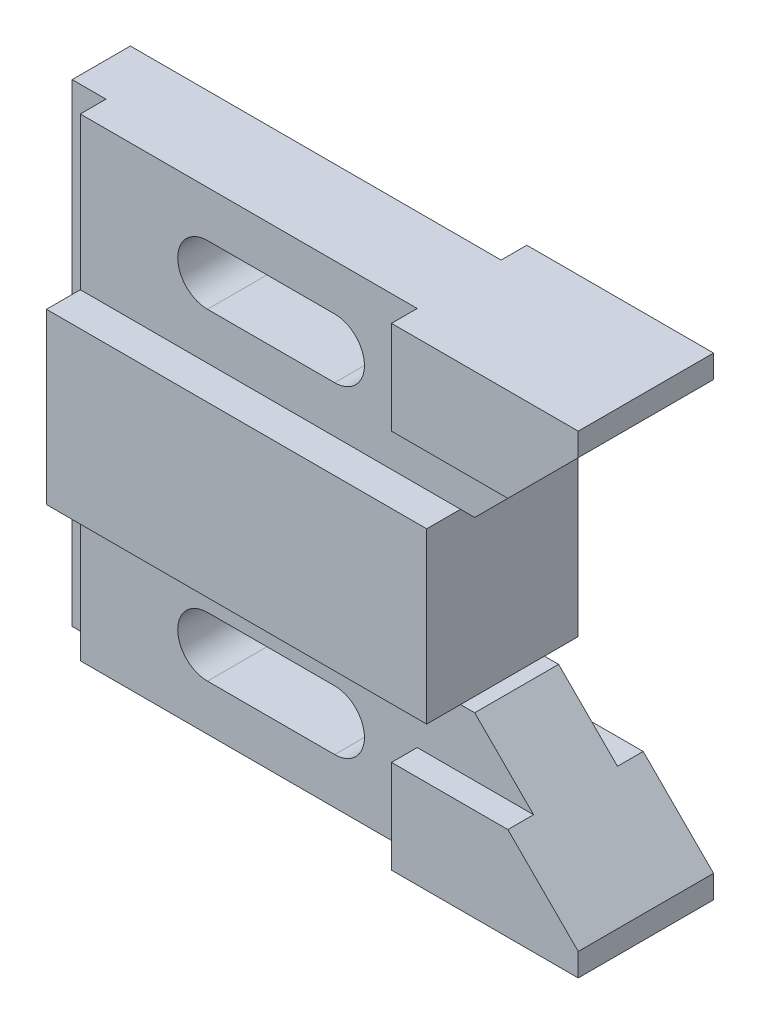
ISO-10303-21;
HEADER;
FILE_DESCRIPTION(('STEP AP214'),'2;1');
FILE_NAME('part.step','',(''),(''),'','','');
FILE_SCHEMA(('AUTOMOTIVE_DESIGN { 1 0 10303 214 1 1 1 1 }'));
ENDSEC;
DATA;
#1=APPLICATION_CONTEXT('core data for automotive mechanical design processes');
#2=APPLICATION_PROTOCOL_DEFINITION('international standard','automotive_design',2000,#1);
#3=PRODUCT_CONTEXT('',#1,'mechanical');
#4=PRODUCT('Part','Part','',(#3));
#5=PRODUCT_RELATED_PRODUCT_CATEGORY('part','',(#4));
#6=PRODUCT_DEFINITION_FORMATION('','',#4);
#7=PRODUCT_DEFINITION_CONTEXT('part definition',#1,'design');
#8=PRODUCT_DEFINITION('design','',#6,#7);
#9=PRODUCT_DEFINITION_SHAPE('','',#8);
#10=(LENGTH_UNIT() NAMED_UNIT(*) SI_UNIT(.MILLI.,.METRE.));
#11=(NAMED_UNIT(*) PLANE_ANGLE_UNIT() SI_UNIT($,.RADIAN.));
#12=(NAMED_UNIT(*) SI_UNIT($,.STERADIAN.) SOLID_ANGLE_UNIT());
#13=UNCERTAINTY_MEASURE_WITH_UNIT(LENGTH_MEASURE(1.E-05),#10,'distance_accuracy_value','');
#14=(GEOMETRIC_REPRESENTATION_CONTEXT(3) GLOBAL_UNCERTAINTY_ASSIGNED_CONTEXT((#13)) GLOBAL_UNIT_ASSIGNED_CONTEXT((#10,
#11,#12)) REPRESENTATION_CONTEXT('',''));
#15=CARTESIAN_POINT('',(0.,0.,0.));
#16=DIRECTION('',(0.,0.,1.));
#17=DIRECTION('',(1.,0.,0.));
#18=AXIS2_PLACEMENT_3D('',#15,#16,#17);
#19=CARTESIAN_POINT('',(0.,0.,-7.874));
#20=DIRECTION('',(0.,0.,-1.));
#21=DIRECTION('',(1.,0.,0.));
#22=AXIS2_PLACEMENT_3D('',#19,#20,#21);
#23=PLANE('',#22);
#24=CARTESIAN_POINT('',(30.226,-14.224,-7.874));
#25=DIRECTION('',(0.,0.,1.));
#26=DIRECTION('',(1.,0.,0.));
#27=AXIS2_PLACEMENT_3D('',#24,#25,#26);
#28=CIRCLE('',#27,5.588);
#29=CARTESIAN_POINT('',(30.226,-8.63599999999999,-7.874));
#30=VERTEX_POINT('',#29);
#31=CARTESIAN_POINT('',(30.226,-19.812,-7.874));
#32=VERTEX_POINT('',#31);
#33=EDGE_CURVE('E623',#30,#32,#28,.T.);
#34=ORIENTED_EDGE('',*,*,#33,.T.);
#35=DIRECTION('',(1.,0.,0.));
#36=VECTOR('',#35,1.);
#37=CARTESIAN_POINT('',(30.226,-19.812,-7.874));
#38=LINE('',#37,#36);
#39=CARTESIAN_POINT('',(54.102,-19.812,-7.874));
#40=VERTEX_POINT('',#39);
#41=EDGE_CURVE('E486',#32,#40,#38,.T.);
#42=ORIENTED_EDGE('',*,*,#41,.T.);
#43=CARTESIAN_POINT('',(54.102,-14.224,-7.874));
#44=DIRECTION('',(0.,0.,1.));
#45=DIRECTION('',(1.,0.,0.));
#46=AXIS2_PLACEMENT_3D('',#43,#44,#45);
#47=CIRCLE('',#46,5.588);
#48=CARTESIAN_POINT('',(54.102,-8.63599999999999,-7.874));
#49=VERTEX_POINT('',#48);
#50=EDGE_CURVE('E631',#40,#49,#47,.T.);
#51=ORIENTED_EDGE('',*,*,#50,.T.);
#52=DIRECTION('',(-1.,0.,0.));
#53=VECTOR('',#52,1.);
#54=CARTESIAN_POINT('',(30.226,-8.63599999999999,-7.874));
#55=LINE('',#54,#53);
#56=EDGE_CURVE('E633',#49,#30,#55,.T.);
#57=ORIENTED_EDGE('',*,*,#56,.T.);
#58=EDGE_LOOP('',(#34,#42,#51,#57));
#59=FACE_BOUND('',#58,.T.);
#60=DIRECTION('',(-1.,0.,0.));
#61=VECTOR('',#60,1.);
#62=CARTESIAN_POINT('',(6.35000000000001,-28.575,-7.874));
#63=LINE('',#62,#61);
#64=CARTESIAN_POINT('',(77.724,-28.575,-7.874));
#65=VERTEX_POINT('',#64);
#66=CARTESIAN_POINT('',(0.,-28.575,-7.874));
#67=VERTEX_POINT('',#66);
#68=EDGE_CURVE('E62',#65,#67,#63,.T.);
#69=ORIENTED_EDGE('',*,*,#68,.T.);
#70=DIRECTION('',(0.,-1.,0.));
#71=VECTOR('',#70,1.);
#72=CARTESIAN_POINT('',(0.,0.,-7.874));
#73=LINE('',#72,#71);
#74=CARTESIAN_POINT('',(0.,0.,-7.874));
#75=VERTEX_POINT('',#74);
#76=EDGE_CURVE('E304',#75,#67,#73,.T.);
#77=ORIENTED_EDGE('',*,*,#76,.F.);
#78=DIRECTION('',(-1.,0.,0.));
#79=VECTOR('',#78,1.);
#80=CARTESIAN_POINT('',(104.648,0.,-7.874));
#81=LINE('',#80,#79);
#82=CARTESIAN_POINT('',(69.596,0.,-7.874));
#83=VERTEX_POINT('',#82);
#84=EDGE_CURVE('E390',#83,#75,#81,.T.);
#85=ORIENTED_EDGE('',*,*,#84,.F.);
#86=DIRECTION('',(0.,-1.,0.));
#87=VECTOR('',#86,1.);
#88=CARTESIAN_POINT('',(69.596,0.,-7.874));
#89=LINE('',#88,#87);
#90=CARTESIAN_POINT('',(69.596,-17.526,-7.874));
#91=VERTEX_POINT('',#90);
#92=EDGE_CURVE('E353',#83,#91,#89,.T.);
#93=ORIENTED_EDGE('',*,*,#92,.T.);
#94=DIRECTION('',(1.,0.,0.));
#95=VECTOR('',#94,1.);
#96=CARTESIAN_POINT('',(69.596,-17.526,-7.874));
#97=LINE('',#96,#95);
#98=CARTESIAN_POINT('',(91.4394686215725,-17.526,-7.874));
#99=VERTEX_POINT('',#98);
#100=EDGE_CURVE('E348',#91,#99,#97,.T.);
#101=ORIENTED_EDGE('',*,*,#100,.T.);
#102=DIRECTION('',(0.707106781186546,0.707106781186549,0.));
#103=VECTOR('',#102,1.);
#104=CARTESIAN_POINT('',(104.648,-4.31746862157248,-7.874));
#105=LINE('',#104,#103);
#106=CARTESIAN_POINT('',(80.3904686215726,-28.575,-7.874));
#107=VERTEX_POINT('',#106);
#108=EDGE_CURVE('E374',#107,#99,#105,.T.);
#109=ORIENTED_EDGE('',*,*,#108,.F.);
#110=DIRECTION('',(1.,0.,0.));
#111=VECTOR('',#110,1.);
#112=CARTESIAN_POINT('',(80.3904686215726,-28.575,-7.874));
#113=LINE('',#112,#111);
#114=EDGE_CURVE('E492',#65,#107,#113,.T.);
#115=ORIENTED_EDGE('',*,*,#114,.F.);
#116=EDGE_LOOP('',(#69,#77,#85,#93,#101,#109,#115));
#117=FACE_BOUND('',#116,.T.);
#118=ADVANCED_FACE('F37',(#59,#117),#23,.T.);
#119=CARTESIAN_POINT('',(30.226,-74.676,-7.874));
#120=DIRECTION('',(0.,0.,1.));
#121=DIRECTION('',(1.,0.,0.));
#122=AXIS2_PLACEMENT_3D('',#119,#120,#121);
#123=CIRCLE('',#122,5.58800000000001);
#124=CARTESIAN_POINT('',(30.226,-69.088,-7.874));
#125=VERTEX_POINT('',#124);
#126=CARTESIAN_POINT('',(30.226,-80.264,-7.874));
#127=VERTEX_POINT('',#126);
#128=EDGE_CURVE('E379',#125,#127,#123,.T.);
#129=ORIENTED_EDGE('',*,*,#128,.T.);
#130=DIRECTION('',(1.,0.,0.));
#131=VECTOR('',#130,1.);
#132=CARTESIAN_POINT('',(30.226,-80.264,-7.874));
#133=LINE('',#132,#131);
#134=CARTESIAN_POINT('',(54.102,-80.264,-7.874));
#135=VERTEX_POINT('',#134);
#136=EDGE_CURVE('E634',#127,#135,#133,.T.);
#137=ORIENTED_EDGE('',*,*,#136,.T.);
#138=CARTESIAN_POINT('',(54.102,-74.676,-7.874));
#139=DIRECTION('',(0.,0.,1.));
#140=DIRECTION('',(1.,0.,0.));
#141=AXIS2_PLACEMENT_3D('',#138,#139,#140);
#142=CIRCLE('',#141,5.58800000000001);
#143=CARTESIAN_POINT('',(54.102,-69.088,-7.874));
#144=VERTEX_POINT('',#143);
#145=EDGE_CURVE('E638',#135,#144,#142,.T.);
#146=ORIENTED_EDGE('',*,*,#145,.T.);
#147=DIRECTION('',(-1.,0.,0.));
#148=VECTOR('',#147,1.);
#149=CARTESIAN_POINT('',(30.226,-69.088,-7.874));
#150=LINE('',#149,#148);
#151=EDGE_CURVE('E1207',#144,#125,#150,.T.);
#152=ORIENTED_EDGE('',*,*,#151,.T.);
#153=EDGE_LOOP('',(#129,#137,#146,#152));
#154=FACE_BOUND('',#153,.T.);
#155=CARTESIAN_POINT('',(0.,-60.325,-7.874));
#156=VERTEX_POINT('',#155);
#157=CARTESIAN_POINT('',(0.,-88.9,-7.874));
#158=VERTEX_POINT('',#157);
#159=EDGE_CURVE('E503',#156,#158,#73,.T.);
#160=ORIENTED_EDGE('',*,*,#159,.F.);
#161=DIRECTION('',(1.,0.,0.));
#162=VECTOR('',#161,1.);
#163=CARTESIAN_POINT('',(6.35000000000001,-60.325,-7.874));
#164=LINE('',#163,#162);
#165=CARTESIAN_POINT('',(77.724,-60.325,-7.874));
#166=VERTEX_POINT('',#165);
#167=EDGE_CURVE('E54',#156,#166,#164,.T.);
#168=ORIENTED_EDGE('',*,*,#167,.T.);
#169=DIRECTION('',(-1.,0.,0.));
#170=VECTOR('',#169,1.);
#171=CARTESIAN_POINT('',(80.3904686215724,-60.325,-7.874));
#172=LINE('',#171,#170);
#173=CARTESIAN_POINT('',(80.3904686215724,-60.325,-7.874));
#174=VERTEX_POINT('',#173);
#175=EDGE_CURVE('E495',#174,#166,#172,.T.);
#176=ORIENTED_EDGE('',*,*,#175,.F.);
#177=DIRECTION('',(-0.707106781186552,0.707106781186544,0.));
#178=VECTOR('',#177,1.);
#179=CARTESIAN_POINT('',(104.648,-84.5825313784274,-7.874));
#180=LINE('',#179,#178);
#181=CARTESIAN_POINT('',(91.4394686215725,-71.374,-7.874));
#182=VERTEX_POINT('',#181);
#183=EDGE_CURVE('E498',#182,#174,#180,.T.);
#184=ORIENTED_EDGE('',*,*,#183,.F.);
#185=DIRECTION('',(-1.,0.,0.));
#186=VECTOR('',#185,1.);
#187=CARTESIAN_POINT('',(91.4394686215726,-71.374,-7.874));
#188=LINE('',#187,#186);
#189=CARTESIAN_POINT('',(69.596,-71.374,-7.874));
#190=VERTEX_POINT('',#189);
#191=EDGE_CURVE('E320',#182,#190,#188,.T.);
#192=ORIENTED_EDGE('',*,*,#191,.T.);
#193=DIRECTION('',(0.,-1.,0.));
#194=VECTOR('',#193,1.);
#195=CARTESIAN_POINT('',(69.596,-71.374,-7.874));
#196=LINE('',#195,#194);
#197=CARTESIAN_POINT('',(69.596,-88.9,-7.874));
#198=VERTEX_POINT('',#197);
#199=EDGE_CURVE('E325',#190,#198,#196,.T.);
#200=ORIENTED_EDGE('',*,*,#199,.T.);
#201=DIRECTION('',(1.,0.,0.));
#202=VECTOR('',#201,1.);
#203=CARTESIAN_POINT('',(0.,-88.9,-7.874));
#204=LINE('',#203,#202);
#205=EDGE_CURVE('E500',#158,#198,#204,.T.);
#206=ORIENTED_EDGE('',*,*,#205,.F.);
#207=EDGE_LOOP('',(#160,#168,#176,#184,#192,#200,#206));
#208=FACE_BOUND('',#207,.T.);
#209=ADVANCED_FACE('F656',(#154,#208),#23,.T.);
#210=CARTESIAN_POINT('',(0.,0.,7.874));
#211=DIRECTION('',(0.,0.,1.));
#212=DIRECTION('',(1.,0.,0.));
#213=AXIS2_PLACEMENT_3D('',#210,#211,#212);
#214=PLANE('',#213);
#215=DIRECTION('',(1.,0.,0.));
#216=VECTOR('',#215,1.);
#217=CARTESIAN_POINT('',(30.226,-80.264,7.874));
#218=LINE('',#217,#216);
#219=CARTESIAN_POINT('',(30.226,-80.264,7.874));
#220=VERTEX_POINT('',#219);
#221=CARTESIAN_POINT('',(54.102,-80.264,7.874));
#222=VERTEX_POINT('',#221);
#223=EDGE_CURVE('E585',#220,#222,#218,.T.);
#224=ORIENTED_EDGE('',*,*,#223,.F.);
#225=CARTESIAN_POINT('',(30.226,-74.676,7.874));
#226=DIRECTION('',(0.,0.,1.));
#227=DIRECTION('',(1.,0.,0.));
#228=AXIS2_PLACEMENT_3D('',#225,#226,#227);
#229=CIRCLE('',#228,5.58800000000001);
#230=CARTESIAN_POINT('',(30.226,-69.088,7.874));
#231=VERTEX_POINT('',#230);
#232=EDGE_CURVE('E583',#231,#220,#229,.T.);
#233=ORIENTED_EDGE('',*,*,#232,.F.);
#234=DIRECTION('',(-1.,0.,0.));
#235=VECTOR('',#234,1.);
#236=CARTESIAN_POINT('',(30.226,-69.088,7.874));
#237=LINE('',#236,#235);
#238=CARTESIAN_POINT('',(54.102,-69.088,7.874));
#239=VERTEX_POINT('',#238);
#240=EDGE_CURVE('E590',#239,#231,#237,.T.);
#241=ORIENTED_EDGE('',*,*,#240,.F.);
#242=CARTESIAN_POINT('',(54.102,-74.676,7.874));
#243=DIRECTION('',(0.,0.,1.));
#244=DIRECTION('',(1.,0.,0.));
#245=AXIS2_PLACEMENT_3D('',#242,#243,#244);
#246=CIRCLE('',#245,5.58800000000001);
#247=EDGE_CURVE('E587',#222,#239,#246,.T.);
#248=ORIENTED_EDGE('',*,*,#247,.F.);
#249=EDGE_LOOP('',(#224,#233,#241,#248));
#250=FACE_BOUND('',#249,.T.);
#251=DIRECTION('',(-1.,0.,0.));
#252=VECTOR('',#251,1.);
#253=CARTESIAN_POINT('',(80.3904686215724,-60.325,7.874));
#254=LINE('',#253,#252);
#255=CARTESIAN_POINT('',(80.3904686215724,-60.325,7.874));
#256=VERTEX_POINT('',#255);
#257=CARTESIAN_POINT('',(77.724,-60.325,7.874));
#258=VERTEX_POINT('',#257);
#259=EDGE_CURVE('E449',#256,#258,#254,.T.);
#260=ORIENTED_EDGE('',*,*,#259,.T.);
#261=DIRECTION('',(1.,0.,0.));
#262=VECTOR('',#261,1.);
#263=CARTESIAN_POINT('',(6.35000000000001,-60.325,7.874));
#264=LINE('',#263,#262);
#265=CARTESIAN_POINT('',(6.35000000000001,-60.325,7.874));
#266=VERTEX_POINT('',#265);
#267=EDGE_CURVE('E505',#266,#258,#264,.T.);
#268=ORIENTED_EDGE('',*,*,#267,.F.);
#269=DIRECTION('',(0.,1.,0.));
#270=VECTOR('',#269,1.);
#271=CARTESIAN_POINT('',(6.35,0.,7.874));
#272=LINE('',#271,#270);
#273=CARTESIAN_POINT('',(6.35000000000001,-88.9,7.874));
#274=VERTEX_POINT('',#273);
#275=EDGE_CURVE('E533',#274,#266,#272,.T.);
#276=ORIENTED_EDGE('',*,*,#275,.F.);
#277=DIRECTION('',(1.,0.,0.));
#278=VECTOR('',#277,1.);
#279=CARTESIAN_POINT('',(0.,-88.9,7.874));
#280=LINE('',#279,#278);
#281=CARTESIAN_POINT('',(69.596,-88.9,7.874));
#282=VERTEX_POINT('',#281);
#283=EDGE_CURVE('E439',#274,#282,#280,.T.);
#284=ORIENTED_EDGE('',*,*,#283,.T.);
#285=DIRECTION('',(0.,-1.,0.));
#286=VECTOR('',#285,1.);
#287=CARTESIAN_POINT('',(69.596,-71.374,7.874));
#288=LINE('',#287,#286);
#289=CARTESIAN_POINT('',(69.596,-71.374,7.874));
#290=VERTEX_POINT('',#289);
#291=EDGE_CURVE('E552',#290,#282,#288,.T.);
#292=ORIENTED_EDGE('',*,*,#291,.F.);
#293=DIRECTION('',(-1.,0.,0.));
#294=VECTOR('',#293,1.);
#295=CARTESIAN_POINT('',(91.4394686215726,-71.374,7.874));
#296=LINE('',#295,#294);
#297=CARTESIAN_POINT('',(91.4394686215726,-71.374,7.874));
#298=VERTEX_POINT('',#297);
#299=EDGE_CURVE('E545',#298,#290,#296,.T.);
#300=ORIENTED_EDGE('',*,*,#299,.F.);
#301=DIRECTION('',(-0.707106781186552,0.707106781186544,0.));
#302=VECTOR('',#301,1.);
#303=CARTESIAN_POINT('',(104.648,-84.5825313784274,7.874));
#304=LINE('',#303,#302);
#305=EDGE_CURVE('E447',#298,#256,#304,.T.);
#306=ORIENTED_EDGE('',*,*,#305,.T.);
#307=EDGE_LOOP('',(#260,#268,#276,#284,#292,#300,#306));
#308=FACE_BOUND('',#307,.T.);
#309=ADVANCED_FACE('F649',(#250,#308),#214,.T.);
#310=DIRECTION('',(1.,0.,0.));
#311=VECTOR('',#310,1.);
#312=CARTESIAN_POINT('',(30.226,-19.812,7.874));
#313=LINE('',#312,#311);
#314=CARTESIAN_POINT('',(30.226,-19.812,7.874));
#315=VERTEX_POINT('',#314);
#316=CARTESIAN_POINT('',(54.102,-19.812,7.874));
#317=VERTEX_POINT('',#316);
#318=EDGE_CURVE('E602',#315,#317,#313,.T.);
#319=ORIENTED_EDGE('',*,*,#318,.F.);
#320=CARTESIAN_POINT('',(30.226,-14.224,7.874));
#321=DIRECTION('',(0.,0.,1.));
#322=DIRECTION('',(1.,0.,0.));
#323=AXIS2_PLACEMENT_3D('',#320,#321,#322);
#324=CIRCLE('',#323,5.588);
#325=CARTESIAN_POINT('',(30.226,-8.63599999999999,7.874));
#326=VERTEX_POINT('',#325);
#327=EDGE_CURVE('E600',#326,#315,#324,.T.);
#328=ORIENTED_EDGE('',*,*,#327,.F.);
#329=DIRECTION('',(-1.,0.,0.));
#330=VECTOR('',#329,1.);
#331=CARTESIAN_POINT('',(30.226,-8.63599999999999,7.874));
#332=LINE('',#331,#330);
#333=CARTESIAN_POINT('',(54.102,-8.63599999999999,7.874));
#334=VERTEX_POINT('',#333);
#335=EDGE_CURVE('E607',#334,#326,#332,.T.);
#336=ORIENTED_EDGE('',*,*,#335,.F.);
#337=CARTESIAN_POINT('',(54.102,-14.224,7.874));
#338=DIRECTION('',(0.,0.,1.));
#339=DIRECTION('',(1.,0.,0.));
#340=AXIS2_PLACEMENT_3D('',#337,#338,#339);
#341=CIRCLE('',#340,5.588);
#342=EDGE_CURVE('E604',#317,#334,#341,.T.);
#343=ORIENTED_EDGE('',*,*,#342,.F.);
#344=EDGE_LOOP('',(#319,#328,#336,#343));
#345=FACE_BOUND('',#344,.T.);
#346=CARTESIAN_POINT('',(6.35,-28.575,7.874));
#347=VERTEX_POINT('',#346);
#348=CARTESIAN_POINT('',(6.35,0.,7.874));
#349=VERTEX_POINT('',#348);
#350=EDGE_CURVE('E528',#347,#349,#272,.T.);
#351=ORIENTED_EDGE('',*,*,#350,.F.);
#352=DIRECTION('',(-1.,0.,0.));
#353=VECTOR('',#352,1.);
#354=CARTESIAN_POINT('',(6.35000000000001,-28.575,7.874));
#355=LINE('',#354,#353);
#356=CARTESIAN_POINT('',(77.724,-28.575,7.874));
#357=VERTEX_POINT('',#356);
#358=EDGE_CURVE('E510',#357,#347,#355,.T.);
#359=ORIENTED_EDGE('',*,*,#358,.F.);
#360=DIRECTION('',(1.,0.,0.));
#361=VECTOR('',#360,1.);
#362=CARTESIAN_POINT('',(80.3904686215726,-28.575,7.874));
#363=LINE('',#362,#361);
#364=CARTESIAN_POINT('',(80.3904686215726,-28.575,7.874));
#365=VERTEX_POINT('',#364);
#366=EDGE_CURVE('E452',#357,#365,#363,.T.);
#367=ORIENTED_EDGE('',*,*,#366,.T.);
#368=DIRECTION('',(0.707106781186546,0.707106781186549,0.));
#369=VECTOR('',#368,1.);
#370=CARTESIAN_POINT('',(104.648,-4.31746862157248,7.874));
#371=LINE('',#370,#369);
#372=CARTESIAN_POINT('',(91.4394686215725,-17.526,7.874));
#373=VERTEX_POINT('',#372);
#374=EDGE_CURVE('E417',#365,#373,#371,.T.);
#375=ORIENTED_EDGE('',*,*,#374,.T.);
#376=DIRECTION('',(1.,0.,0.));
#377=VECTOR('',#376,1.);
#378=CARTESIAN_POINT('',(69.596,-17.526,7.874));
#379=LINE('',#378,#377);
#380=CARTESIAN_POINT('',(69.596,-17.526,7.874));
#381=VERTEX_POINT('',#380);
#382=EDGE_CURVE('E462',#381,#373,#379,.T.);
#383=ORIENTED_EDGE('',*,*,#382,.F.);
#384=DIRECTION('',(0.,-1.,0.));
#385=VECTOR('',#384,1.);
#386=CARTESIAN_POINT('',(69.596,0.,7.874));
#387=LINE('',#386,#385);
#388=CARTESIAN_POINT('',(69.596,0.,7.874));
#389=VERTEX_POINT('',#388);
#390=EDGE_CURVE('E474',#389,#381,#387,.T.);
#391=ORIENTED_EDGE('',*,*,#390,.F.);
#392=DIRECTION('',(-1.,0.,0.));
#393=VECTOR('',#392,1.);
#394=CARTESIAN_POINT('',(104.648,0.,7.874));
#395=LINE('',#394,#393);
#396=EDGE_CURVE('E435',#389,#349,#395,.T.);
#397=ORIENTED_EDGE('',*,*,#396,.T.);
#398=EDGE_LOOP('',(#351,#359,#367,#375,#383,#391,#397));
#399=FACE_BOUND('',#398,.T.);
#400=ADVANCED_FACE('F461',(#345,#399),#214,.T.);
#401=CARTESIAN_POINT('',(104.648,0.,7.874));
#402=DIRECTION('',(0.,-1.,0.));
#403=DIRECTION('',(1.,0.,0.));
#404=AXIS2_PLACEMENT_3D('',#401,#402,#403);
#405=PLANE('',#404);
#406=DIRECTION('',(-1.,0.,0.));
#407=VECTOR('',#406,1.);
#408=CARTESIAN_POINT('',(6.35,0.,3.048));
#409=LINE('',#408,#407);
#410=CARTESIAN_POINT('',(6.35,0.,3.048));
#411=VERTEX_POINT('',#410);
#412=CARTESIAN_POINT('',(0.,0.,3.048));
#413=VERTEX_POINT('',#412);
#414=EDGE_CURVE('E532',#411,#413,#409,.T.);
#415=ORIENTED_EDGE('',*,*,#414,.F.);
#416=DIRECTION('',(0.,0.,1.));
#417=VECTOR('',#416,1.);
#418=CARTESIAN_POINT('',(6.35,0.,3.048));
#419=LINE('',#418,#417);
#420=EDGE_CURVE('E540',#411,#349,#419,.T.);
#421=ORIENTED_EDGE('',*,*,#420,.T.);
#422=ORIENTED_EDGE('',*,*,#396,.F.);
#423=DIRECTION('',(0.,0.,-1.));
#424=VECTOR('',#423,1.);
#425=CARTESIAN_POINT('',(69.596,0.,12.7));
#426=LINE('',#425,#424);
#427=CARTESIAN_POINT('',(69.596,0.,12.7));
#428=VERTEX_POINT('',#427);
#429=EDGE_CURVE('E478',#428,#389,#426,.T.);
#430=ORIENTED_EDGE('',*,*,#429,.F.);
#431=DIRECTION('',(-1.,0.,0.));
#432=VECTOR('',#431,1.);
#433=CARTESIAN_POINT('',(69.596,0.,12.7));
#434=LINE('',#433,#432);
#435=CARTESIAN_POINT('',(104.648,0.,12.7));
#436=VERTEX_POINT('',#435);
#437=EDGE_CURVE('E473',#436,#428,#434,.T.);
#438=ORIENTED_EDGE('',*,*,#437,.F.);
#439=DIRECTION('',(0.,0.,-1.));
#440=VECTOR('',#439,1.);
#441=CARTESIAN_POINT('',(104.648,0.,7.874));
#442=LINE('',#441,#440);
#443=CARTESIAN_POINT('',(104.648,0.,-12.7));
#444=VERTEX_POINT('',#443);
#445=EDGE_CURVE('E407',#436,#444,#442,.T.);
#446=ORIENTED_EDGE('',*,*,#445,.T.);
#447=DIRECTION('',(-1.,0.,0.));
#448=VECTOR('',#447,1.);
#449=CARTESIAN_POINT('',(69.596,0.,-12.7));
#450=LINE('',#449,#448);
#451=CARTESIAN_POINT('',(69.596,0.,-12.7));
#452=VERTEX_POINT('',#451);
#453=EDGE_CURVE('E349',#444,#452,#450,.T.);
#454=ORIENTED_EDGE('',*,*,#453,.T.);
#455=DIRECTION('',(0.,0.,1.));
#456=VECTOR('',#455,1.);
#457=CARTESIAN_POINT('',(69.596,0.,-12.7));
#458=LINE('',#457,#456);
#459=EDGE_CURVE('E365',#452,#83,#458,.T.);
#460=ORIENTED_EDGE('',*,*,#459,.T.);
#461=ORIENTED_EDGE('',*,*,#84,.T.);
#462=DIRECTION('',(0.,0.,-1.));
#463=VECTOR('',#462,1.);
#464=CARTESIAN_POINT('',(0.,0.,7.874));
#465=LINE('',#464,#463);
#466=EDGE_CURVE('E11',#413,#75,#465,.T.);
#467=ORIENTED_EDGE('',*,*,#466,.F.);
#468=EDGE_LOOP('',(#415,#421,#422,#430,#438,#446,#454,#460,#461,#467));
#469=FACE_BOUND('',#468,.T.);
#470=ADVANCED_FACE('F39',(#469),#405,.F.);
#471=CARTESIAN_POINT('',(0.,0.,7.874));
#472=DIRECTION('',(1.,0.,0.));
#473=DIRECTION('',(0.,1.,0.));
#474=AXIS2_PLACEMENT_3D('',#471,#472,#473);
#475=PLANE('',#474);
#476=DIRECTION('',(0.,0.,-1.));
#477=VECTOR('',#476,1.);
#478=CARTESIAN_POINT('',(0.,-88.9,7.874));
#479=LINE('',#478,#477);
#480=CARTESIAN_POINT('',(0.,-88.9,3.048));
#481=VERTEX_POINT('',#480);
#482=EDGE_CURVE('E46',#481,#158,#479,.T.);
#483=ORIENTED_EDGE('',*,*,#482,.F.);
#484=DIRECTION('',(0.,-1.,0.));
#485=VECTOR('',#484,1.);
#486=CARTESIAN_POINT('',(0.,0.,3.048));
#487=LINE('',#486,#485);
#488=EDGE_CURVE('E535',#413,#481,#487,.T.);
#489=ORIENTED_EDGE('',*,*,#488,.F.);
#490=ORIENTED_EDGE('',*,*,#466,.T.);
#491=ORIENTED_EDGE('',*,*,#76,.T.);
#492=DIRECTION('',(0.,0.,1.));
#493=VECTOR('',#492,1.);
#494=CARTESIAN_POINT('',(0.,-28.575,-7.874));
#495=LINE('',#494,#493);
#496=CARTESIAN_POINT('',(0.,-28.575,-14.224));
#497=VERTEX_POINT('',#496);
#498=EDGE_CURVE('E289',#497,#67,#495,.T.);
#499=ORIENTED_EDGE('',*,*,#498,.F.);
#500=DIRECTION('',(0.,1.,0.));
#501=VECTOR('',#500,1.);
#502=CARTESIAN_POINT('',(0.,-28.575,-14.224));
#503=LINE('',#502,#501);
#504=CARTESIAN_POINT('',(0.,-60.325,-14.224));
#505=VERTEX_POINT('',#504);
#506=EDGE_CURVE('E303',#505,#497,#503,.T.);
#507=ORIENTED_EDGE('',*,*,#506,.F.);
#508=DIRECTION('',(0.,0.,-1.));
#509=VECTOR('',#508,1.);
#510=CARTESIAN_POINT('',(0.,-60.325,-14.224));
#511=LINE('',#510,#509);
#512=EDGE_CURVE('E305',#156,#505,#511,.T.);
#513=ORIENTED_EDGE('',*,*,#512,.F.);
#514=ORIENTED_EDGE('',*,*,#159,.T.);
#515=EDGE_LOOP('',(#483,#489,#490,#491,#499,#507,#513,#514));
#516=FACE_BOUND('',#515,.T.);
#517=ADVANCED_FACE('F301',(#516),#475,.F.);
#518=CARTESIAN_POINT('',(0.,-88.9,7.874));
#519=DIRECTION('',(0.,1.,0.));
#520=DIRECTION('',(-1.,0.,0.));
#521=AXIS2_PLACEMENT_3D('',#518,#519,#520);
#522=PLANE('',#521);
#523=ORIENTED_EDGE('',*,*,#283,.F.);
#524=DIRECTION('',(0.,0.,1.));
#525=VECTOR('',#524,1.);
#526=CARTESIAN_POINT('',(6.35000000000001,-88.9,3.048));
#527=LINE('',#526,#525);
#528=CARTESIAN_POINT('',(6.35000000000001,-88.9,3.048));
#529=VERTEX_POINT('',#528);
#530=EDGE_CURVE('E543',#529,#274,#527,.T.);
#531=ORIENTED_EDGE('',*,*,#530,.F.);
#532=DIRECTION('',(1.,0.,0.));
#533=VECTOR('',#532,1.);
#534=CARTESIAN_POINT('',(6.35000000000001,-88.9,3.048));
#535=LINE('',#534,#533);
#536=EDGE_CURVE('E537',#481,#529,#535,.T.);
#537=ORIENTED_EDGE('',*,*,#536,.F.);
#538=ORIENTED_EDGE('',*,*,#482,.T.);
#539=ORIENTED_EDGE('',*,*,#205,.T.);
#540=DIRECTION('',(0.,0.,1.));
#541=VECTOR('',#540,1.);
#542=CARTESIAN_POINT('',(69.596,-88.9,-12.7));
#543=LINE('',#542,#541);
#544=CARTESIAN_POINT('',(69.596,-88.9,-12.7));
#545=VERTEX_POINT('',#544);
#546=EDGE_CURVE('E343',#545,#198,#543,.T.);
#547=ORIENTED_EDGE('',*,*,#546,.F.);
#548=DIRECTION('',(1.,0.,0.));
#549=VECTOR('',#548,1.);
#550=CARTESIAN_POINT('',(69.596,-88.9,-12.7));
#551=LINE('',#550,#549);
#552=CARTESIAN_POINT('',(104.648,-88.9,-12.7));
#553=VERTEX_POINT('',#552);
#554=EDGE_CURVE('E331',#545,#553,#551,.T.);
#555=ORIENTED_EDGE('',*,*,#554,.T.);
#556=DIRECTION('',(0.,0.,-1.));
#557=VECTOR('',#556,1.);
#558=CARTESIAN_POINT('',(104.648,-88.9,7.874));
#559=LINE('',#558,#557);
#560=CARTESIAN_POINT('',(104.648,-88.9,12.7));
#561=VERTEX_POINT('',#560);
#562=EDGE_CURVE('E431',#561,#553,#559,.T.);
#563=ORIENTED_EDGE('',*,*,#562,.F.);
#564=DIRECTION('',(1.,0.,0.));
#565=VECTOR('',#564,1.);
#566=CARTESIAN_POINT('',(69.596,-88.9,12.7));
#567=LINE('',#566,#565);
#568=CARTESIAN_POINT('',(69.596,-88.9,12.7));
#569=VERTEX_POINT('',#568);
#570=EDGE_CURVE('E554',#569,#561,#567,.T.);
#571=ORIENTED_EDGE('',*,*,#570,.F.);
#572=DIRECTION('',(0.,0.,-1.));
#573=VECTOR('',#572,1.);
#574=CARTESIAN_POINT('',(69.596,-88.9,12.7));
#575=LINE('',#574,#573);
#576=EDGE_CURVE('E569',#569,#282,#575,.T.);
#577=ORIENTED_EDGE('',*,*,#576,.T.);
#578=EDGE_LOOP('',(#523,#531,#537,#538,#539,#547,#555,#563,#571,#577));
#579=FACE_BOUND('',#578,.T.);
#580=ADVANCED_FACE('F760',(#579),#522,.F.);
#581=CARTESIAN_POINT('',(104.648,-88.9,7.874));
#582=DIRECTION('',(-1.,0.,0.));
#583=DIRECTION('',(0.,0.,1.));
#584=AXIS2_PLACEMENT_3D('',#581,#582,#583);
#585=PLANE('',#584);
#586=ORIENTED_EDGE('',*,*,#562,.T.);
#587=DIRECTION('',(0.,1.,0.));
#588=VECTOR('',#587,1.);
#589=CARTESIAN_POINT('',(104.648,-88.9,-12.7));
#590=LINE('',#589,#588);
#591=CARTESIAN_POINT('',(104.648,-84.5825313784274,-12.7));
#592=VERTEX_POINT('',#591);
#593=EDGE_CURVE('E328',#553,#592,#590,.T.);
#594=ORIENTED_EDGE('',*,*,#593,.T.);
#595=DIRECTION('',(0.,0.,-1.));
#596=VECTOR('',#595,1.);
#597=CARTESIAN_POINT('',(104.648,-84.5825313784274,7.874));
#598=LINE('',#597,#596);
#599=CARTESIAN_POINT('',(104.648,-84.5825313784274,12.7));
#600=VERTEX_POINT('',#599);
#601=EDGE_CURVE('E429',#600,#592,#598,.T.);
#602=ORIENTED_EDGE('',*,*,#601,.F.);
#603=DIRECTION('',(0.,1.,0.));
#604=VECTOR('',#603,1.);
#605=CARTESIAN_POINT('',(104.648,-88.9,12.7));
#606=LINE('',#605,#604);
#607=EDGE_CURVE('E557',#561,#600,#606,.T.);
#608=ORIENTED_EDGE('',*,*,#607,.F.);
#609=EDGE_LOOP('',(#586,#594,#602,#608));
#610=FACE_BOUND('',#609,.T.);
#611=ADVANCED_FACE('F756',(#610),#585,.F.);
#612=CARTESIAN_POINT('',(104.648,-84.5825313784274,7.874));
#613=DIRECTION('',(-0.707106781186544,-0.707106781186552,0.));
#614=DIRECTION('',(0.707106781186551,-0.707106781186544,0.));
#615=AXIS2_PLACEMENT_3D('',#612,#613,#614);
#616=PLANE('',#615);
#617=ORIENTED_EDGE('',*,*,#601,.T.);
#618=DIRECTION('',(-0.707106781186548,0.707106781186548,0.));
#619=VECTOR('',#618,1.);
#620=CARTESIAN_POINT('',(104.648,-84.5825313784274,-12.7));
#621=LINE('',#620,#619);
#622=CARTESIAN_POINT('',(91.4394686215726,-71.374,-12.7));
#623=VERTEX_POINT('',#622);
#624=EDGE_CURVE('E324',#592,#623,#621,.T.);
#625=ORIENTED_EDGE('',*,*,#624,.T.);
#626=DIRECTION('',(0.,0.,1.));
#627=VECTOR('',#626,1.);
#628=CARTESIAN_POINT('',(91.4394686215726,-71.374,-12.7));
#629=LINE('',#628,#627);
#630=EDGE_CURVE('E345',#623,#182,#629,.T.);
#631=ORIENTED_EDGE('',*,*,#630,.T.);
#632=ORIENTED_EDGE('',*,*,#183,.T.);
#633=DIRECTION('',(0.,0.,-1.));
#634=VECTOR('',#633,1.);
#635=CARTESIAN_POINT('',(80.3904686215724,-60.325,7.874));
#636=LINE('',#635,#634);
#637=EDGE_CURVE('E426',#256,#174,#636,.T.);
#638=ORIENTED_EDGE('',*,*,#637,.F.);
#639=ORIENTED_EDGE('',*,*,#305,.F.);
#640=DIRECTION('',(0.,0.,-1.));
#641=VECTOR('',#640,1.);
#642=CARTESIAN_POINT('',(91.4394686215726,-71.374,12.7));
#643=LINE('',#642,#641);
#644=CARTESIAN_POINT('',(91.4394686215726,-71.374,12.7));
#645=VERTEX_POINT('',#644);
#646=EDGE_CURVE('E562',#645,#298,#643,.T.);
#647=ORIENTED_EDGE('',*,*,#646,.F.);
#648=DIRECTION('',(-0.707106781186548,0.707106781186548,0.));
#649=VECTOR('',#648,1.);
#650=CARTESIAN_POINT('',(104.648,-84.5825313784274,12.7));
#651=LINE('',#650,#649);
#652=EDGE_CURVE('E560',#600,#645,#651,.T.);
#653=ORIENTED_EDGE('',*,*,#652,.F.);
#654=EDGE_LOOP('',(#617,#625,#631,#632,#638,#639,#647,#653));
#655=FACE_BOUND('',#654,.T.);
#656=ADVANCED_FACE('F752',(#655),#616,.F.);
#657=CARTESIAN_POINT('',(80.3904686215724,-60.325,7.874));
#658=DIRECTION('',(0.,-1.,0.));
#659=DIRECTION('',(0.,0.,-1.));
#660=AXIS2_PLACEMENT_3D('',#657,#658,#659);
#661=PLANE('',#660);
#662=ORIENTED_EDGE('',*,*,#637,.T.);
#663=ORIENTED_EDGE('',*,*,#175,.T.);
#664=DIRECTION('',(0.,0.,-1.));
#665=VECTOR('',#664,1.);
#666=CARTESIAN_POINT('',(77.724,-60.325,7.874));
#667=LINE('',#666,#665);
#668=EDGE_CURVE('E423',#258,#166,#667,.T.);
#669=ORIENTED_EDGE('',*,*,#668,.F.);
#670=ORIENTED_EDGE('',*,*,#259,.F.);
#671=EDGE_LOOP('',(#662,#663,#669,#670));
#672=FACE_BOUND('',#671,.T.);
#673=ADVANCED_FACE('F748',(#672),#661,.F.);
#674=CARTESIAN_POINT('',(77.724,-28.575,7.874));
#675=DIRECTION('',(-1.,0.,0.));
#676=DIRECTION('',(0.,0.,1.));
#677=AXIS2_PLACEMENT_3D('',#674,#675,#676);
#678=PLANE('',#677);
#679=ORIENTED_EDGE('',*,*,#668,.T.);
#680=DIRECTION('',(0.,0.,1.));
#681=VECTOR('',#680,1.);
#682=CARTESIAN_POINT('',(77.724,-60.325,-14.224));
#683=LINE('',#682,#681);
#684=CARTESIAN_POINT('',(77.724,-60.325,-14.224));
#685=VERTEX_POINT('',#684);
#686=EDGE_CURVE('E315',#685,#166,#683,.T.);
#687=ORIENTED_EDGE('',*,*,#686,.F.);
#688=DIRECTION('',(0.,1.,0.));
#689=VECTOR('',#688,1.);
#690=CARTESIAN_POINT('',(77.724,-28.575,-14.224));
#691=LINE('',#690,#689);
#692=CARTESIAN_POINT('',(77.724,-28.575,-14.224));
#693=VERTEX_POINT('',#692);
#694=EDGE_CURVE('E296',#685,#693,#691,.T.);
#695=ORIENTED_EDGE('',*,*,#694,.T.);
#696=DIRECTION('',(0.,0.,1.));
#697=VECTOR('',#696,1.);
#698=CARTESIAN_POINT('',(77.724,-28.575,-14.224));
#699=LINE('',#698,#697);
#700=EDGE_CURVE('E291',#693,#65,#699,.T.);
#701=ORIENTED_EDGE('',*,*,#700,.T.);
#702=DIRECTION('',(0.,0.,-1.));
#703=VECTOR('',#702,1.);
#704=CARTESIAN_POINT('',(77.724,-28.575,7.874));
#705=LINE('',#704,#703);
#706=EDGE_CURVE('E415',#357,#65,#705,.T.);
#707=ORIENTED_EDGE('',*,*,#706,.F.);
#708=DIRECTION('',(0.,0.,-1.));
#709=VECTOR('',#708,1.);
#710=CARTESIAN_POINT('',(77.724,-28.575,14.224));
#711=LINE('',#710,#709);
#712=CARTESIAN_POINT('',(77.724,-28.575,14.224));
#713=VERTEX_POINT('',#712);
#714=EDGE_CURVE('E521',#713,#357,#711,.T.);
#715=ORIENTED_EDGE('',*,*,#714,.F.);
#716=DIRECTION('',(0.,1.,0.));
#717=VECTOR('',#716,1.);
#718=CARTESIAN_POINT('',(77.724,-28.575,14.224));
#719=LINE('',#718,#717);
#720=CARTESIAN_POINT('',(77.724,-60.325,14.224));
#721=VERTEX_POINT('',#720);
#722=EDGE_CURVE('E512',#721,#713,#719,.T.);
#723=ORIENTED_EDGE('',*,*,#722,.F.);
#724=DIRECTION('',(0.,0.,-1.));
#725=VECTOR('',#724,1.);
#726=CARTESIAN_POINT('',(77.724,-60.325,14.224));
#727=LINE('',#726,#725);
#728=EDGE_CURVE('E523',#721,#258,#727,.T.);
#729=ORIENTED_EDGE('',*,*,#728,.T.);
#730=EDGE_LOOP('',(#679,#687,#695,#701,#707,#715,#723,#729));
#731=FACE_BOUND('',#730,.T.);
#732=ADVANCED_FACE('F744',(#731),#678,.F.);
#733=CARTESIAN_POINT('',(80.3904686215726,-28.575,7.874));
#734=DIRECTION('',(0.,1.,0.));
#735=DIRECTION('',(0.,0.,1.));
#736=AXIS2_PLACEMENT_3D('',#733,#734,#735);
#737=PLANE('',#736);
#738=ORIENTED_EDGE('',*,*,#706,.T.);
#739=ORIENTED_EDGE('',*,*,#114,.T.);
#740=DIRECTION('',(0.,0.,-1.));
#741=VECTOR('',#740,1.);
#742=CARTESIAN_POINT('',(80.3904686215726,-28.575,7.874));
#743=LINE('',#742,#741);
#744=EDGE_CURVE('E413',#365,#107,#743,.T.);
#745=ORIENTED_EDGE('',*,*,#744,.F.);
#746=ORIENTED_EDGE('',*,*,#366,.F.);
#747=EDGE_LOOP('',(#738,#739,#745,#746));
#748=FACE_BOUND('',#747,.T.);
#749=ADVANCED_FACE('F739',(#748),#737,.F.);
#750=CARTESIAN_POINT('',(104.648,-4.31746862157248,7.874));
#751=DIRECTION('',(-0.707106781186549,0.707106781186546,0.));
#752=DIRECTION('',(-0.707106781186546,-0.707106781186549,0.));
#753=AXIS2_PLACEMENT_3D('',#750,#751,#752);
#754=PLANE('',#753);
#755=ORIENTED_EDGE('',*,*,#744,.T.);
#756=ORIENTED_EDGE('',*,*,#108,.T.);
#757=DIRECTION('',(0.,0.,1.));
#758=VECTOR('',#757,1.);
#759=CARTESIAN_POINT('',(91.4394686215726,-17.526,-12.7));
#760=LINE('',#759,#758);
#761=CARTESIAN_POINT('',(91.4394686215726,-17.526,-12.7));
#762=VERTEX_POINT('',#761);
#763=EDGE_CURVE('E377',#762,#99,#760,.T.);
#764=ORIENTED_EDGE('',*,*,#763,.F.);
#765=DIRECTION('',(0.707106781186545,0.70710678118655,0.));
#766=VECTOR('',#765,1.);
#767=CARTESIAN_POINT('',(104.648,-4.31746862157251,-12.7));
#768=LINE('',#767,#766);
#769=CARTESIAN_POINT('',(104.648,-4.31746862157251,-12.7));
#770=VERTEX_POINT('',#769);
#771=EDGE_CURVE('E356',#762,#770,#768,.T.);
#772=ORIENTED_EDGE('',*,*,#771,.T.);
#773=DIRECTION('',(0.,0.,-1.));
#774=VECTOR('',#773,1.);
#775=CARTESIAN_POINT('',(104.648,-4.31746862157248,7.874));
#776=LINE('',#775,#774);
#777=CARTESIAN_POINT('',(104.648,-4.31746862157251,12.7));
#778=VERTEX_POINT('',#777);
#779=EDGE_CURVE('E409',#778,#770,#776,.T.);
#780=ORIENTED_EDGE('',*,*,#779,.F.);
#781=DIRECTION('',(0.707106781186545,0.70710678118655,0.));
#782=VECTOR('',#781,1.);
#783=CARTESIAN_POINT('',(104.648,-4.31746862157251,12.7));
#784=LINE('',#783,#782);
#785=CARTESIAN_POINT('',(91.4394686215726,-17.526,12.7));
#786=VERTEX_POINT('',#785);
#787=EDGE_CURVE('E476',#786,#778,#784,.T.);
#788=ORIENTED_EDGE('',*,*,#787,.F.);
#789=DIRECTION('',(0.,0.,-1.));
#790=VECTOR('',#789,1.);
#791=CARTESIAN_POINT('',(91.4394686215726,-17.526,12.7));
#792=LINE('',#791,#790);
#793=EDGE_CURVE('E470',#786,#373,#792,.T.);
#794=ORIENTED_EDGE('',*,*,#793,.T.);
#795=ORIENTED_EDGE('',*,*,#374,.F.);
#796=EDGE_LOOP('',(#755,#756,#764,#772,#780,#788,#794,#795));
#797=FACE_BOUND('',#796,.T.);
#798=ADVANCED_FACE('F399',(#797),#754,.F.);
#799=CARTESIAN_POINT('',(104.648,0.,7.874));
#800=DIRECTION('',(-1.,0.,0.));
#801=DIRECTION('',(0.,0.,1.));
#802=AXIS2_PLACEMENT_3D('',#799,#800,#801);
#803=PLANE('',#802);
#804=ORIENTED_EDGE('',*,*,#779,.T.);
#805=DIRECTION('',(0.,1.,0.));
#806=VECTOR('',#805,1.);
#807=CARTESIAN_POINT('',(104.648,0.,-12.7));
#808=LINE('',#807,#806);
#809=EDGE_CURVE('E352',#770,#444,#808,.T.);
#810=ORIENTED_EDGE('',*,*,#809,.T.);
#811=ORIENTED_EDGE('',*,*,#445,.F.);
#812=DIRECTION('',(0.,1.,0.));
#813=VECTOR('',#812,1.);
#814=CARTESIAN_POINT('',(104.648,0.,12.7));
#815=LINE('',#814,#813);
#816=EDGE_CURVE('E410',#778,#436,#815,.T.);
#817=ORIENTED_EDGE('',*,*,#816,.F.);
#818=EDGE_LOOP('',(#804,#810,#811,#817));
#819=FACE_BOUND('',#818,.T.);
#820=ADVANCED_FACE('F405',(#819),#803,.F.);
#821=CARTESIAN_POINT('',(30.226,-14.224,7.874));
#822=DIRECTION('',(0.,0.,-1.));
#823=DIRECTION('',(-1.,0.,0.));
#824=AXIS2_PLACEMENT_3D('',#821,#822,#823);
#825=CYLINDRICAL_SURFACE('',#824,5.588);
#826=DIRECTION('',(0.,0.,-1.));
#827=VECTOR('',#826,1.);
#828=CARTESIAN_POINT('',(30.226,-19.812,7.874));
#829=LINE('',#828,#827);
#830=EDGE_CURVE('E440',#315,#32,#829,.T.);
#831=ORIENTED_EDGE('',*,*,#830,.T.);
#832=ORIENTED_EDGE('',*,*,#33,.F.);
#833=DIRECTION('',(0.,0.,-1.));
#834=VECTOR('',#833,1.);
#835=CARTESIAN_POINT('',(30.226,-8.63599999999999,7.874));
#836=LINE('',#835,#834);
#837=EDGE_CURVE('E609',#326,#30,#836,.T.);
#838=ORIENTED_EDGE('',*,*,#837,.F.);
#839=ORIENTED_EDGE('',*,*,#327,.T.);
#840=EDGE_LOOP('',(#831,#832,#838,#839));
#841=FACE_BOUND('',#840,.T.);
#842=ADVANCED_FACE('F620',(#841),#825,.F.);
#843=CARTESIAN_POINT('',(30.226,-19.812,7.874));
#844=DIRECTION('',(0.,1.,0.));
#845=DIRECTION('',(0.,0.,1.));
#846=AXIS2_PLACEMENT_3D('',#843,#844,#845);
#847=PLANE('',#846);
#848=DIRECTION('',(0.,0.,-1.));
#849=VECTOR('',#848,1.);
#850=CARTESIAN_POINT('',(54.102,-19.812,7.874));
#851=LINE('',#850,#849);
#852=EDGE_CURVE('E612',#317,#40,#851,.T.);
#853=ORIENTED_EDGE('',*,*,#852,.T.);
#854=ORIENTED_EDGE('',*,*,#41,.F.);
#855=ORIENTED_EDGE('',*,*,#830,.F.);
#856=ORIENTED_EDGE('',*,*,#318,.T.);
#857=EDGE_LOOP('',(#853,#854,#855,#856));
#858=FACE_BOUND('',#857,.T.);
#859=ADVANCED_FACE('F628',(#858),#847,.T.);
#860=CARTESIAN_POINT('',(54.102,-14.224,7.874));
#861=DIRECTION('',(0.,0.,-1.));
#862=DIRECTION('',(-1.,0.,0.));
#863=AXIS2_PLACEMENT_3D('',#860,#861,#862);
#864=CYLINDRICAL_SURFACE('',#863,5.588);
#865=DIRECTION('',(0.,0.,-1.));
#866=VECTOR('',#865,1.);
#867=CARTESIAN_POINT('',(54.102,-8.63599999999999,7.874));
#868=LINE('',#867,#866);
#869=EDGE_CURVE('E611',#334,#49,#868,.T.);
#870=ORIENTED_EDGE('',*,*,#869,.T.);
#871=ORIENTED_EDGE('',*,*,#50,.F.);
#872=ORIENTED_EDGE('',*,*,#852,.F.);
#873=ORIENTED_EDGE('',*,*,#342,.T.);
#874=EDGE_LOOP('',(#870,#871,#872,#873));
#875=FACE_BOUND('',#874,.T.);
#876=ADVANCED_FACE('F642',(#875),#864,.F.);
#877=CARTESIAN_POINT('',(30.226,-8.63599999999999,7.874));
#878=DIRECTION('',(0.,-1.,0.));
#879=DIRECTION('',(0.,0.,-1.));
#880=AXIS2_PLACEMENT_3D('',#877,#878,#879);
#881=PLANE('',#880);
#882=ORIENTED_EDGE('',*,*,#837,.T.);
#883=ORIENTED_EDGE('',*,*,#56,.F.);
#884=ORIENTED_EDGE('',*,*,#869,.F.);
#885=ORIENTED_EDGE('',*,*,#335,.T.);
#886=EDGE_LOOP('',(#882,#883,#884,#885));
#887=FACE_BOUND('',#886,.T.);
#888=ADVANCED_FACE('F646',(#887),#881,.T.);
#889=CARTESIAN_POINT('',(30.226,-74.676,7.874));
#890=DIRECTION('',(0.,0.,-1.));
#891=DIRECTION('',(-1.,0.,0.));
#892=AXIS2_PLACEMENT_3D('',#889,#890,#891);
#893=CYLINDRICAL_SURFACE('',#892,5.58800000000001);
#894=DIRECTION('',(0.,0.,-1.));
#895=VECTOR('',#894,1.);
#896=CARTESIAN_POINT('',(30.226,-80.264,7.874));
#897=LINE('',#896,#895);
#898=EDGE_CURVE('E598',#220,#127,#897,.T.);
#899=ORIENTED_EDGE('',*,*,#898,.T.);
#900=ORIENTED_EDGE('',*,*,#128,.F.);
#901=DIRECTION('',(0.,0.,-1.));
#902=VECTOR('',#901,1.);
#903=CARTESIAN_POINT('',(30.226,-69.088,7.874));
#904=LINE('',#903,#902);
#905=EDGE_CURVE('E592',#231,#125,#904,.T.);
#906=ORIENTED_EDGE('',*,*,#905,.F.);
#907=ORIENTED_EDGE('',*,*,#232,.T.);
#908=EDGE_LOOP('',(#899,#900,#906,#907));
#909=FACE_BOUND('',#908,.T.);
#910=ADVANCED_FACE('F722',(#909),#893,.F.);
#911=CARTESIAN_POINT('',(30.226,-80.264,7.874));
#912=DIRECTION('',(0.,1.,0.));
#913=DIRECTION('',(0.,0.,1.));
#914=AXIS2_PLACEMENT_3D('',#911,#912,#913);
#915=PLANE('',#914);
#916=DIRECTION('',(0.,0.,-1.));
#917=VECTOR('',#916,1.);
#918=CARTESIAN_POINT('',(54.102,-80.264,7.874));
#919=LINE('',#918,#917);
#920=EDGE_CURVE('E596',#222,#135,#919,.T.);
#921=ORIENTED_EDGE('',*,*,#920,.T.);
#922=ORIENTED_EDGE('',*,*,#136,.F.);
#923=ORIENTED_EDGE('',*,*,#898,.F.);
#924=ORIENTED_EDGE('',*,*,#223,.T.);
#925=EDGE_LOOP('',(#921,#922,#923,#924));
#926=FACE_BOUND('',#925,.T.);
#927=ADVANCED_FACE('F718',(#926),#915,.T.);
#928=CARTESIAN_POINT('',(54.102,-74.676,7.874));
#929=DIRECTION('',(0.,0.,-1.));
#930=DIRECTION('',(-1.,0.,0.));
#931=AXIS2_PLACEMENT_3D('',#928,#929,#930);
#932=CYLINDRICAL_SURFACE('',#931,5.58800000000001);
#933=DIRECTION('',(0.,0.,-1.));
#934=VECTOR('',#933,1.);
#935=CARTESIAN_POINT('',(54.102,-69.088,7.874));
#936=LINE('',#935,#934);
#937=EDGE_CURVE('E594',#239,#144,#936,.T.);
#938=ORIENTED_EDGE('',*,*,#937,.T.);
#939=ORIENTED_EDGE('',*,*,#145,.F.);
#940=ORIENTED_EDGE('',*,*,#920,.F.);
#941=ORIENTED_EDGE('',*,*,#247,.T.);
#942=EDGE_LOOP('',(#938,#939,#940,#941));
#943=FACE_BOUND('',#942,.T.);
#944=ADVANCED_FACE('F714',(#943),#932,.F.);
#945=CARTESIAN_POINT('',(30.226,-69.088,7.874));
#946=DIRECTION('',(0.,-1.,0.));
#947=DIRECTION('',(0.,0.,-1.));
#948=AXIS2_PLACEMENT_3D('',#945,#946,#947);
#949=PLANE('',#948);
#950=ORIENTED_EDGE('',*,*,#905,.T.);
#951=ORIENTED_EDGE('',*,*,#151,.F.);
#952=ORIENTED_EDGE('',*,*,#937,.F.);
#953=ORIENTED_EDGE('',*,*,#240,.T.);
#954=EDGE_LOOP('',(#950,#951,#952,#953));
#955=FACE_BOUND('',#954,.T.);
#956=ADVANCED_FACE('F710',(#955),#949,.T.);
#957=CARTESIAN_POINT('',(69.596,0.,12.7));
#958=DIRECTION('',(1.,0.,0.));
#959=DIRECTION('',(0.,0.,-1.));
#960=AXIS2_PLACEMENT_3D('',#957,#958,#959);
#961=PLANE('',#960);
#962=ORIENTED_EDGE('',*,*,#390,.T.);
#963=DIRECTION('',(0.,0.,-1.));
#964=VECTOR('',#963,1.);
#965=CARTESIAN_POINT('',(69.596,-17.526,12.7));
#966=LINE('',#965,#964);
#967=CARTESIAN_POINT('',(69.596,-17.526,12.7));
#968=VERTEX_POINT('',#967);
#969=EDGE_CURVE('E472',#968,#381,#966,.T.);
#970=ORIENTED_EDGE('',*,*,#969,.F.);
#971=DIRECTION('',(0.,-1.,0.));
#972=VECTOR('',#971,1.);
#973=CARTESIAN_POINT('',(69.596,0.,12.7));
#974=LINE('',#973,#972);
#975=EDGE_CURVE('E577',#428,#968,#974,.T.);
#976=ORIENTED_EDGE('',*,*,#975,.F.);
#977=ORIENTED_EDGE('',*,*,#429,.T.);
#978=EDGE_LOOP('',(#962,#970,#976,#977));
#979=FACE_BOUND('',#978,.T.);
#980=ADVANCED_FACE('F707',(#979),#961,.F.);
#981=CARTESIAN_POINT('',(69.596,-17.526,12.7));
#982=DIRECTION('',(0.,1.,0.));
#983=DIRECTION('',(0.,0.,1.));
#984=AXIS2_PLACEMENT_3D('',#981,#982,#983);
#985=PLANE('',#984);
#986=ORIENTED_EDGE('',*,*,#382,.T.);
#987=ORIENTED_EDGE('',*,*,#793,.F.);
#988=DIRECTION('',(1.,0.,0.));
#989=VECTOR('',#988,1.);
#990=CARTESIAN_POINT('',(69.596,-17.526,12.7));
#991=LINE('',#990,#989);
#992=EDGE_CURVE('E579',#968,#786,#991,.T.);
#993=ORIENTED_EDGE('',*,*,#992,.F.);
#994=ORIENTED_EDGE('',*,*,#969,.T.);
#995=EDGE_LOOP('',(#986,#987,#993,#994));
#996=FACE_BOUND('',#995,.T.);
#997=ADVANCED_FACE('F468',(#996),#985,.F.);
#998=CARTESIAN_POINT('',(0.,0.,12.7));
#999=DIRECTION('',(0.,0.,-1.));
#1000=DIRECTION('',(-1.,0.,0.));
#1001=AXIS2_PLACEMENT_3D('',#998,#999,#1000);
#1002=PLANE('',#1001);
#1003=ORIENTED_EDGE('',*,*,#437,.T.);
#1004=ORIENTED_EDGE('',*,*,#975,.T.);
#1005=ORIENTED_EDGE('',*,*,#992,.T.);
#1006=ORIENTED_EDGE('',*,*,#787,.T.);
#1007=ORIENTED_EDGE('',*,*,#816,.T.);
#1008=EDGE_LOOP('',(#1003,#1004,#1005,#1006,#1007));
#1009=FACE_BOUND('',#1008,.T.);
#1010=ADVANCED_FACE('F700',(#1009),#1002,.F.);
#1011=CARTESIAN_POINT('',(91.4394686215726,-71.374,12.7));
#1012=DIRECTION('',(0.,-1.,0.));
#1013=DIRECTION('',(0.,0.,-1.));
#1014=AXIS2_PLACEMENT_3D('',#1011,#1012,#1013);
#1015=PLANE('',#1014);
#1016=ORIENTED_EDGE('',*,*,#299,.T.);
#1017=DIRECTION('',(0.,0.,-1.));
#1018=VECTOR('',#1017,1.);
#1019=CARTESIAN_POINT('',(69.596,-71.374,12.7));
#1020=LINE('',#1019,#1018);
#1021=CARTESIAN_POINT('',(69.596,-71.374,12.7));
#1022=VERTEX_POINT('',#1021);
#1023=EDGE_CURVE('E572',#1022,#290,#1020,.T.);
#1024=ORIENTED_EDGE('',*,*,#1023,.F.);
#1025=DIRECTION('',(-1.,0.,0.));
#1026=VECTOR('',#1025,1.);
#1027=CARTESIAN_POINT('',(91.4394686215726,-71.374,12.7));
#1028=LINE('',#1027,#1026);
#1029=EDGE_CURVE('E548',#645,#1022,#1028,.T.);
#1030=ORIENTED_EDGE('',*,*,#1029,.F.);
#1031=ORIENTED_EDGE('',*,*,#646,.T.);
#1032=EDGE_LOOP('',(#1016,#1024,#1030,#1031));
#1033=FACE_BOUND('',#1032,.T.);
#1034=ADVANCED_FACE('F696',(#1033),#1015,.F.);
#1035=CARTESIAN_POINT('',(69.596,-71.374,12.7));
#1036=DIRECTION('',(1.,0.,0.));
#1037=DIRECTION('',(0.,0.,-1.));
#1038=AXIS2_PLACEMENT_3D('',#1035,#1036,#1037);
#1039=PLANE('',#1038);
#1040=ORIENTED_EDGE('',*,*,#291,.T.);
#1041=ORIENTED_EDGE('',*,*,#576,.F.);
#1042=DIRECTION('',(0.,-1.,0.));
#1043=VECTOR('',#1042,1.);
#1044=CARTESIAN_POINT('',(69.596,-71.374,12.7));
#1045=LINE('',#1044,#1043);
#1046=EDGE_CURVE('E551',#1022,#569,#1045,.T.);
#1047=ORIENTED_EDGE('',*,*,#1046,.F.);
#1048=ORIENTED_EDGE('',*,*,#1023,.T.);
#1049=EDGE_LOOP('',(#1040,#1041,#1047,#1048));
#1050=FACE_BOUND('',#1049,.T.);
#1051=ADVANCED_FACE('F692',(#1050),#1039,.F.);
#1052=CARTESIAN_POINT('',(0.,0.,12.7));
#1053=DIRECTION('',(0.,0.,1.));
#1054=DIRECTION('',(1.,0.,0.));
#1055=AXIS2_PLACEMENT_3D('',#1052,#1053,#1054);
#1056=PLANE('',#1055);
#1057=ORIENTED_EDGE('',*,*,#1029,.T.);
#1058=ORIENTED_EDGE('',*,*,#1046,.T.);
#1059=ORIENTED_EDGE('',*,*,#570,.T.);
#1060=ORIENTED_EDGE('',*,*,#607,.T.);
#1061=ORIENTED_EDGE('',*,*,#652,.T.);
#1062=EDGE_LOOP('',(#1057,#1058,#1059,#1060,#1061));
#1063=FACE_BOUND('',#1062,.T.);
#1064=ADVANCED_FACE('F688',(#1063),#1056,.T.);
#1065=CARTESIAN_POINT('',(6.35,0.,3.048));
#1066=DIRECTION('',(1.,0.,0.));
#1067=DIRECTION('',(0.,1.,0.));
#1068=AXIS2_PLACEMENT_3D('',#1065,#1066,#1067);
#1069=PLANE('',#1068);
#1070=ORIENTED_EDGE('',*,*,#275,.T.);
#1071=DIRECTION('',(0.,0.,-1.));
#1072=VECTOR('',#1071,1.);
#1073=CARTESIAN_POINT('',(6.35000000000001,-60.325,14.224));
#1074=LINE('',#1073,#1072);
#1075=CARTESIAN_POINT('',(6.35000000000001,-60.325,14.224));
#1076=VERTEX_POINT('',#1075);
#1077=EDGE_CURVE('E526',#1076,#266,#1074,.T.);
#1078=ORIENTED_EDGE('',*,*,#1077,.F.);
#1079=DIRECTION('',(0.,-1.,0.));
#1080=VECTOR('',#1079,1.);
#1081=CARTESIAN_POINT('',(6.35000000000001,-28.575,14.224));
#1082=LINE('',#1081,#1080);
#1083=CARTESIAN_POINT('',(6.35000000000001,-28.575,14.224));
#1084=VERTEX_POINT('',#1083);
#1085=EDGE_CURVE('E506',#1084,#1076,#1082,.T.);
#1086=ORIENTED_EDGE('',*,*,#1085,.F.);
#1087=DIRECTION('',(0.,0.,-1.));
#1088=VECTOR('',#1087,1.);
#1089=CARTESIAN_POINT('',(6.35000000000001,-28.575,14.224));
#1090=LINE('',#1089,#1088);
#1091=EDGE_CURVE('E516',#1084,#347,#1090,.T.);
#1092=ORIENTED_EDGE('',*,*,#1091,.T.);
#1093=ORIENTED_EDGE('',*,*,#350,.T.);
#1094=ORIENTED_EDGE('',*,*,#420,.F.);
#1095=DIRECTION('',(0.,1.,0.));
#1096=VECTOR('',#1095,1.);
#1097=CARTESIAN_POINT('',(6.35,0.,3.048));
#1098=LINE('',#1097,#1096);
#1099=EDGE_CURVE('E529',#529,#411,#1098,.T.);
#1100=ORIENTED_EDGE('',*,*,#1099,.F.);
#1101=ORIENTED_EDGE('',*,*,#530,.T.);
#1102=EDGE_LOOP('',(#1070,#1078,#1086,#1092,#1093,#1094,#1100,#1101));
#1103=FACE_BOUND('',#1102,.T.);
#1104=ADVANCED_FACE('F684',(#1103),#1069,.F.);
#1105=CARTESIAN_POINT('',(0.,0.,3.048));
#1106=DIRECTION('',(0.,0.,-1.));
#1107=DIRECTION('',(-1.,0.,0.));
#1108=AXIS2_PLACEMENT_3D('',#1105,#1106,#1107);
#1109=PLANE('',#1108);
#1110=ORIENTED_EDGE('',*,*,#1099,.T.);
#1111=ORIENTED_EDGE('',*,*,#414,.T.);
#1112=ORIENTED_EDGE('',*,*,#488,.T.);
#1113=ORIENTED_EDGE('',*,*,#536,.T.);
#1114=EDGE_LOOP('',(#1110,#1111,#1112,#1113));
#1115=FACE_BOUND('',#1114,.T.);
#1116=ADVANCED_FACE('F680',(#1115),#1109,.F.);
#1117=CARTESIAN_POINT('',(6.35000000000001,-60.325,14.224));
#1118=DIRECTION('',(0.,1.,0.));
#1119=DIRECTION('',(0.,0.,1.));
#1120=AXIS2_PLACEMENT_3D('',#1117,#1118,#1119);
#1121=PLANE('',#1120);
#1122=ORIENTED_EDGE('',*,*,#267,.T.);
#1123=ORIENTED_EDGE('',*,*,#728,.F.);
#1124=DIRECTION('',(1.,0.,0.));
#1125=VECTOR('',#1124,1.);
#1126=CARTESIAN_POINT('',(6.35000000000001,-60.325,14.224));
#1127=LINE('',#1126,#1125);
#1128=EDGE_CURVE('E509',#1076,#721,#1127,.T.);
#1129=ORIENTED_EDGE('',*,*,#1128,.F.);
#1130=ORIENTED_EDGE('',*,*,#1077,.T.);
#1131=EDGE_LOOP('',(#1122,#1123,#1129,#1130));
#1132=FACE_BOUND('',#1131,.T.);
#1133=ADVANCED_FACE('F676',(#1132),#1121,.F.);
#1134=CARTESIAN_POINT('',(6.35000000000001,-28.575,14.224));
#1135=DIRECTION('',(0.,-1.,0.));
#1136=DIRECTION('',(0.,0.,-1.));
#1137=AXIS2_PLACEMENT_3D('',#1134,#1135,#1136);
#1138=PLANE('',#1137);
#1139=ORIENTED_EDGE('',*,*,#358,.T.);
#1140=ORIENTED_EDGE('',*,*,#1091,.F.);
#1141=DIRECTION('',(-1.,0.,0.));
#1142=VECTOR('',#1141,1.);
#1143=CARTESIAN_POINT('',(6.35000000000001,-28.575,14.224));
#1144=LINE('',#1143,#1142);
#1145=EDGE_CURVE('E514',#713,#1084,#1144,.T.);
#1146=ORIENTED_EDGE('',*,*,#1145,.F.);
#1147=ORIENTED_EDGE('',*,*,#714,.T.);
#1148=EDGE_LOOP('',(#1139,#1140,#1146,#1147));
#1149=FACE_BOUND('',#1148,.T.);
#1150=ADVANCED_FACE('F672',(#1149),#1138,.F.);
#1151=CARTESIAN_POINT('',(0.,0.,14.224));
#1152=DIRECTION('',(0.,0.,1.));
#1153=DIRECTION('',(1.,0.,0.));
#1154=AXIS2_PLACEMENT_3D('',#1151,#1152,#1153);
#1155=PLANE('',#1154);
#1156=ORIENTED_EDGE('',*,*,#1085,.T.);
#1157=ORIENTED_EDGE('',*,*,#1128,.T.);
#1158=ORIENTED_EDGE('',*,*,#722,.T.);
#1159=ORIENTED_EDGE('',*,*,#1145,.T.);
#1160=EDGE_LOOP('',(#1156,#1157,#1158,#1159));
#1161=FACE_BOUND('',#1160,.T.);
#1162=ADVANCED_FACE('F669',(#1161),#1155,.T.);
#1163=CARTESIAN_POINT('',(69.596,-17.526,-12.7));
#1164=DIRECTION('',(0.,-1.,0.));
#1165=DIRECTION('',(0.,0.,-1.));
#1166=AXIS2_PLACEMENT_3D('',#1163,#1164,#1165);
#1167=PLANE('',#1166);
#1168=ORIENTED_EDGE('',*,*,#100,.F.);
#1169=DIRECTION('',(0.,0.,1.));
#1170=VECTOR('',#1169,1.);
#1171=CARTESIAN_POINT('',(69.596,-17.526,-12.7));
#1172=LINE('',#1171,#1170);
#1173=CARTESIAN_POINT('',(69.596,-17.526,-12.7));
#1174=VERTEX_POINT('',#1173);
#1175=EDGE_CURVE('E368',#1174,#91,#1172,.T.);
#1176=ORIENTED_EDGE('',*,*,#1175,.F.);
#1177=DIRECTION('',(1.,0.,0.));
#1178=VECTOR('',#1177,1.);
#1179=CARTESIAN_POINT('',(69.596,-17.526,-12.7));
#1180=LINE('',#1179,#1178);
#1181=EDGE_CURVE('E359',#1174,#762,#1180,.T.);
#1182=ORIENTED_EDGE('',*,*,#1181,.T.);
#1183=ORIENTED_EDGE('',*,*,#763,.T.);
#1184=EDGE_LOOP('',(#1168,#1176,#1182,#1183));
#1185=FACE_BOUND('',#1184,.T.);
#1186=ADVANCED_FACE('F396',(#1185),#1167,.T.);
#1187=CARTESIAN_POINT('',(69.596,0.,-12.7));
#1188=DIRECTION('',(-1.,0.,0.));
#1189=DIRECTION('',(0.,0.,1.));
#1190=AXIS2_PLACEMENT_3D('',#1187,#1188,#1189);
#1191=PLANE('',#1190);
#1192=ORIENTED_EDGE('',*,*,#92,.F.);
#1193=ORIENTED_EDGE('',*,*,#459,.F.);
#1194=DIRECTION('',(0.,-1.,0.));
#1195=VECTOR('',#1194,1.);
#1196=CARTESIAN_POINT('',(69.596,0.,-12.7));
#1197=LINE('',#1196,#1195);
#1198=EDGE_CURVE('E362',#452,#1174,#1197,.T.);
#1199=ORIENTED_EDGE('',*,*,#1198,.T.);
#1200=ORIENTED_EDGE('',*,*,#1175,.T.);
#1201=EDGE_LOOP('',(#1192,#1193,#1199,#1200));
#1202=FACE_BOUND('',#1201,.T.);
#1203=ADVANCED_FACE('F392',(#1202),#1191,.T.);
#1204=CARTESIAN_POINT('',(0.,0.,-12.7));
#1205=DIRECTION('',(0.,0.,1.));
#1206=DIRECTION('',(-1.,0.,0.));
#1207=AXIS2_PLACEMENT_3D('',#1204,#1205,#1206);
#1208=PLANE('',#1207);
#1209=ORIENTED_EDGE('',*,*,#453,.F.);
#1210=ORIENTED_EDGE('',*,*,#809,.F.);
#1211=ORIENTED_EDGE('',*,*,#771,.F.);
#1212=ORIENTED_EDGE('',*,*,#1181,.F.);
#1213=ORIENTED_EDGE('',*,*,#1198,.F.);
#1214=EDGE_LOOP('',(#1209,#1210,#1211,#1212,#1213));
#1215=FACE_BOUND('',#1214,.T.);
#1216=ADVANCED_FACE('F403',(#1215),#1208,.F.);
#1217=CARTESIAN_POINT('',(91.4394686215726,-71.374,-12.7));
#1218=DIRECTION('',(0.,1.,0.));
#1219=DIRECTION('',(0.,0.,1.));
#1220=AXIS2_PLACEMENT_3D('',#1217,#1218,#1219);
#1221=PLANE('',#1220);
#1222=ORIENTED_EDGE('',*,*,#191,.F.);
#1223=ORIENTED_EDGE('',*,*,#630,.F.);
#1224=DIRECTION('',(-1.,0.,0.));
#1225=VECTOR('',#1224,1.);
#1226=CARTESIAN_POINT('',(91.4394686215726,-71.374,-12.7));
#1227=LINE('',#1226,#1225);
#1228=CARTESIAN_POINT('',(69.596,-71.374,-12.7));
#1229=VERTEX_POINT('',#1228);
#1230=EDGE_CURVE('E321',#623,#1229,#1227,.T.);
#1231=ORIENTED_EDGE('',*,*,#1230,.T.);
#1232=DIRECTION('',(0.,0.,1.));
#1233=VECTOR('',#1232,1.);
#1234=CARTESIAN_POINT('',(69.596,-71.374,-12.7));
#1235=LINE('',#1234,#1233);
#1236=EDGE_CURVE('E337',#1229,#190,#1235,.T.);
#1237=ORIENTED_EDGE('',*,*,#1236,.T.);
#1238=EDGE_LOOP('',(#1222,#1223,#1231,#1237));
#1239=FACE_BOUND('',#1238,.T.);
#1240=ADVANCED_FACE('F883',(#1239),#1221,.T.);
#1241=CARTESIAN_POINT('',(69.596,-71.374,-12.7));
#1242=DIRECTION('',(-1.,0.,0.));
#1243=DIRECTION('',(0.,0.,1.));
#1244=AXIS2_PLACEMENT_3D('',#1241,#1242,#1243);
#1245=PLANE('',#1244);
#1246=ORIENTED_EDGE('',*,*,#199,.F.);
#1247=ORIENTED_EDGE('',*,*,#1236,.F.);
#1248=DIRECTION('',(0.,-1.,0.));
#1249=VECTOR('',#1248,1.);
#1250=CARTESIAN_POINT('',(69.596,-71.374,-12.7));
#1251=LINE('',#1250,#1249);
#1252=EDGE_CURVE('E334',#1229,#545,#1251,.T.);
#1253=ORIENTED_EDGE('',*,*,#1252,.T.);
#1254=ORIENTED_EDGE('',*,*,#546,.T.);
#1255=EDGE_LOOP('',(#1246,#1247,#1253,#1254));
#1256=FACE_BOUND('',#1255,.T.);
#1257=ADVANCED_FACE('F892',(#1256),#1245,.T.);
#1258=CARTESIAN_POINT('',(0.,0.,-12.7));
#1259=DIRECTION('',(0.,0.,-1.));
#1260=DIRECTION('',(1.,0.,0.));
#1261=AXIS2_PLACEMENT_3D('',#1258,#1259,#1260);
#1262=PLANE('',#1261);
#1263=ORIENTED_EDGE('',*,*,#1230,.F.);
#1264=ORIENTED_EDGE('',*,*,#624,.F.);
#1265=ORIENTED_EDGE('',*,*,#593,.F.);
#1266=ORIENTED_EDGE('',*,*,#554,.F.);
#1267=ORIENTED_EDGE('',*,*,#1252,.F.);
#1268=EDGE_LOOP('',(#1263,#1264,#1265,#1266,#1267));
#1269=FACE_BOUND('',#1268,.T.);
#1270=ADVANCED_FACE('F902',(#1269),#1262,.T.);
#1271=CARTESIAN_POINT('',(6.35000000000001,-28.575,-14.224));
#1272=DIRECTION('',(0.,1.,0.));
#1273=DIRECTION('',(0.,0.,1.));
#1274=AXIS2_PLACEMENT_3D('',#1271,#1272,#1273);
#1275=PLANE('',#1274);
#1276=ORIENTED_EDGE('',*,*,#68,.F.);
#1277=ORIENTED_EDGE('',*,*,#700,.F.);
#1278=DIRECTION('',(-1.,0.,0.));
#1279=VECTOR('',#1278,1.);
#1280=CARTESIAN_POINT('',(6.35000000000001,-28.575,-14.224));
#1281=LINE('',#1280,#1279);
#1282=EDGE_CURVE('E286',#693,#497,#1281,.T.);
#1283=ORIENTED_EDGE('',*,*,#1282,.T.);
#1284=ORIENTED_EDGE('',*,*,#498,.T.);
#1285=EDGE_LOOP('',(#1276,#1277,#1283,#1284));
#1286=FACE_BOUND('',#1285,.T.);
#1287=ADVANCED_FACE('F288',(#1286),#1275,.T.);
#1288=CARTESIAN_POINT('',(6.35000000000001,-60.325,-14.224));
#1289=DIRECTION('',(0.,-1.,0.));
#1290=DIRECTION('',(0.,0.,-1.));
#1291=AXIS2_PLACEMENT_3D('',#1288,#1289,#1290);
#1292=PLANE('',#1291);
#1293=ORIENTED_EDGE('',*,*,#167,.F.);
#1294=ORIENTED_EDGE('',*,*,#512,.T.);
#1295=DIRECTION('',(1.,0.,0.));
#1296=VECTOR('',#1295,1.);
#1297=CARTESIAN_POINT('',(6.35000000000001,-60.325,-14.224));
#1298=LINE('',#1297,#1296);
#1299=EDGE_CURVE('E309',#505,#685,#1298,.T.);
#1300=ORIENTED_EDGE('',*,*,#1299,.T.);
#1301=ORIENTED_EDGE('',*,*,#686,.T.);
#1302=EDGE_LOOP('',(#1293,#1294,#1300,#1301));
#1303=FACE_BOUND('',#1302,.T.);
#1304=ADVANCED_FACE('F1118',(#1303),#1292,.T.);
#1305=CARTESIAN_POINT('',(0.,0.,-14.224));
#1306=DIRECTION('',(0.,0.,-1.));
#1307=DIRECTION('',(1.,0.,0.));
#1308=AXIS2_PLACEMENT_3D('',#1305,#1306,#1307);
#1309=PLANE('',#1308);
#1310=ORIENTED_EDGE('',*,*,#1299,.F.);
#1311=ORIENTED_EDGE('',*,*,#506,.T.);
#1312=ORIENTED_EDGE('',*,*,#1282,.F.);
#1313=ORIENTED_EDGE('',*,*,#694,.F.);
#1314=EDGE_LOOP('',(#1310,#1311,#1312,#1313));
#1315=FACE_BOUND('',#1314,.T.);
#1316=ADVANCED_FACE('F307',(#1315),#1309,.T.);
#1317=CLOSED_SHELL('',(#118,#209,#309,#400,#470,#517,#580,#611,#656,#673,#732,#749,#798,#820,
#842,#859,#876,#888,#910,#927,#944,#956,#980,#997,#1010,#1034,#1051,#1064,#1104,#1116,#1133,
#1150,#1162,#1186,#1203,#1216,#1240,#1257,#1270,#1287,#1304,#1316));
#1318=MANIFOLD_SOLID_BREP('B2',#1317);
#1319=ADVANCED_BREP_SHAPE_REPRESENTATION('',(#18,#1318),#14);
#1320=SHAPE_DEFINITION_REPRESENTATION(#9,#1319);
ENDSEC;
END-ISO-10303-21;
